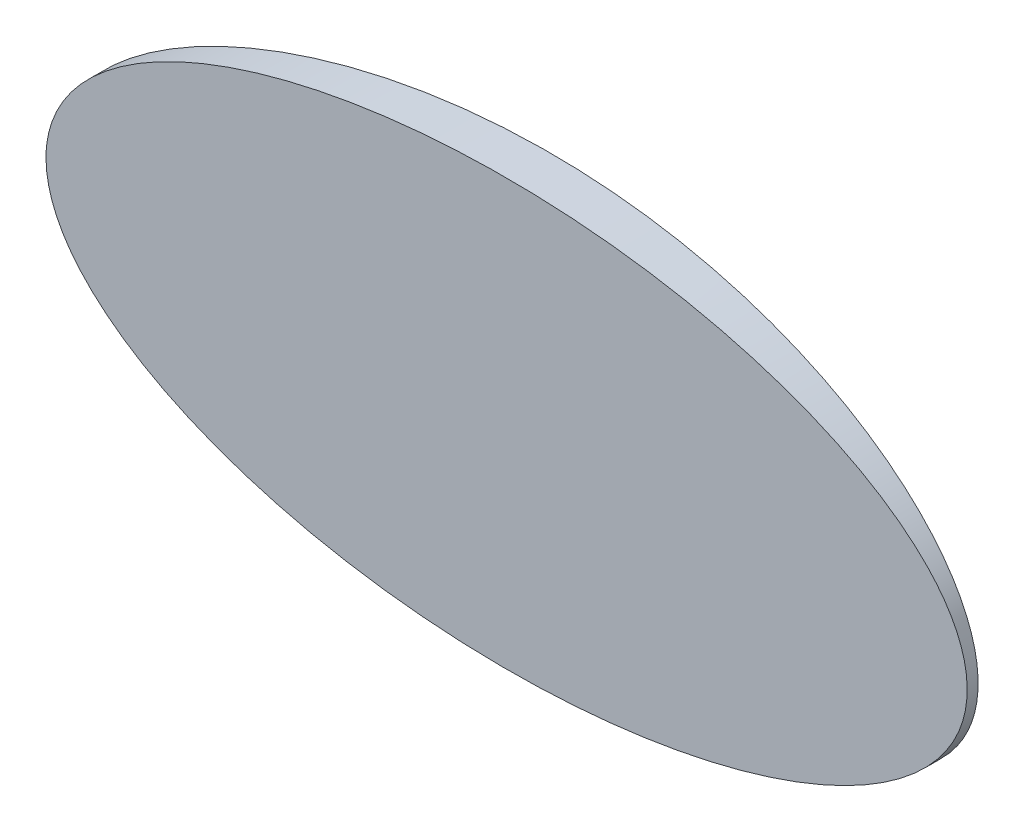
from build123d import *

# Parameters (mm, degrees)
SKIZZE1_RX                           = 80.795819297
SKIZZE1_RY                           = 37.320286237
LINEAR_AUSTRAGEN1_DEPTH              = 10
OBERFL_CHE_LINEAR_AUSTRAGEN1_1_BACK  = 97.5
OBERFL_CHE_LINEAR_AUSTRAGEN1_1_DEPTH = 195


with BuildPart() as part:
    # Skizze1 → Linear austragen1 (new body)
    with BuildSketch(Plane.XY):
        with Locations(Location((0, 0), (0, 0, 180))):
            Ellipse(SKIZZE1_RX, SKIZZE1_RY)
    extrude(amount=-LINEAR_AUSTRAGEN1_DEPTH)

    # Oberfl_chenschnitt1: cut with a surface, the side behind it stays
    # Oberfl_che-Linear austragen1: a surface, the sketch's curves swept straight by 195 mm
    with BuildLine(Plane(origin=(0, 0, 0), x_dir=(0, 0, -1), z_dir=(1, 0, 0)).offset(-OBERFL_CHE_LINEAR_AUSTRAGEN1_1_BACK), mode=Mode.PRIVATE) as oberfl_che_linear_austragen1_1_path:
        CenterArc((126.654653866, 0), 124.740666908, 0, 360)
    oberfl_che_linear_austragen1_1 = Shell.extrude(oberfl_che_linear_austragen1_1_path.wire(), (1 * OBERFL_CHE_LINEAR_AUSTRAGEN1_1_DEPTH, 0 * OBERFL_CHE_LINEAR_AUSTRAGEN1_1_DEPTH, 0 * OBERFL_CHE_LINEAR_AUSTRAGEN1_1_DEPTH))
    split(bisect_by=oberfl_che_linear_austragen1_1, keep=Keep.BOTTOM)


solid = part.part
